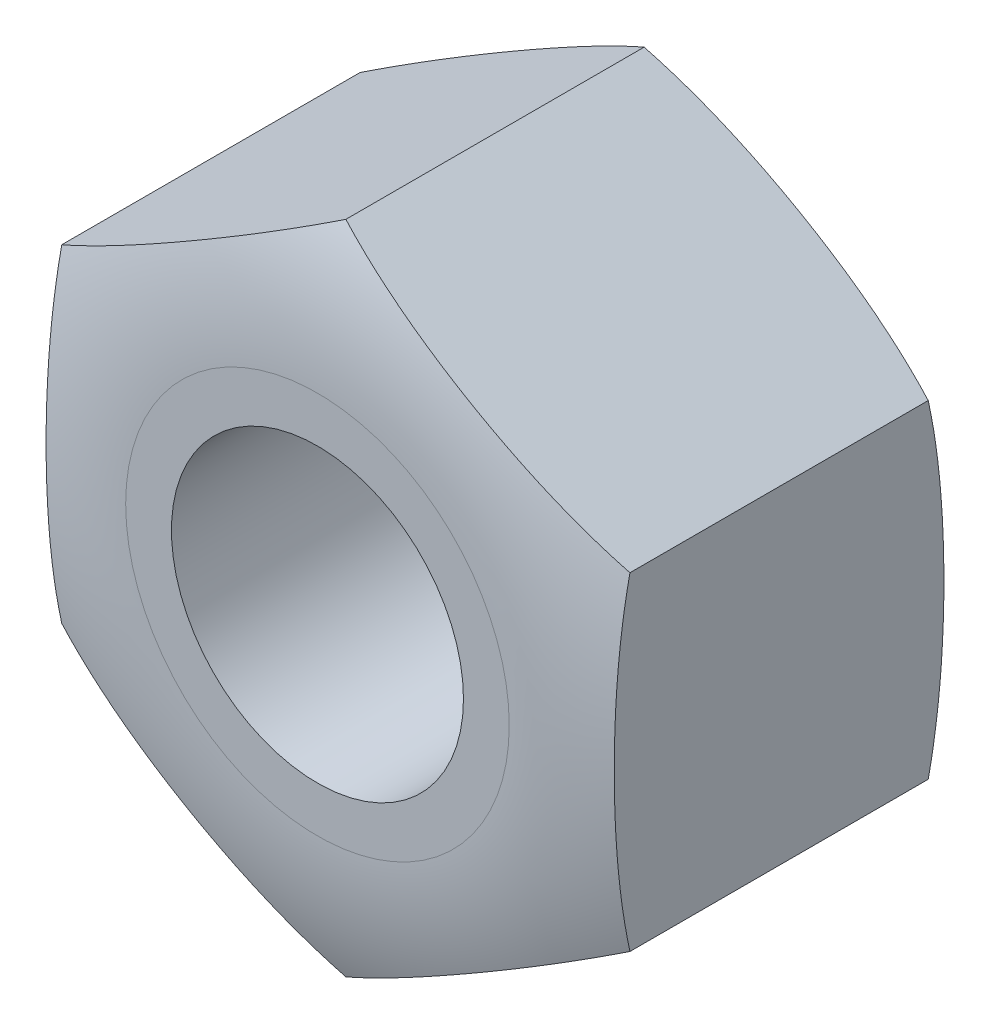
from build123d import *

# Parameters (mm, degrees)
EXTRUDE1_DEPTH           = 3.96875
F_5_16_18_TAPPED_HOLE1_D = 6.5278


with BuildPart() as part:
    # Sketch1 → Extrude1 (new, symmetric)
    with BuildSketch(Plane.XY):
        Polygon((6.35, 3.666174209), (0, 7.332348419), (-6.35, 3.666174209), (-6.35, -3.666174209), (0, -7.332348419), (6.35, -3.666174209), align=None)
    extrude(amount=EXTRUDE1_DEPTH, both=True)

    # 5_16-18 Tapped Hole1 (through all)
    with Locations(Plane.XY.offset(3.96875)):
        with Locations((0, 0)):
            Hole(F_5_16_18_TAPPED_HOLE1_D / 2)

    # Sketch4 → Cut-Revolve1 (revolve, cut)
    with BuildSketch(Plane(origin=(0, 0, 0), x_dir=(0, 0, -1), z_dir=(1, 0, 0)), mode=Mode.PRIVATE) as cut_revolve1_sk:
        with BuildLine():
            Line((-3.96875, 4.286995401), (-3.96875, 7.332348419))
            Line((-3.96875, 7.332348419), (-3.33375, 7.332348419))
            ThreePointArc((-3.33375, 7.332348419), (-3.808310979, 5.842421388), (-3.96875, 4.286995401))
        make_face()
        with BuildLine():
            Line((3.96875, 7.332348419), (3.33375, 7.332348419))
            ThreePointArc((3.33375, 7.332348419), (3.808310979, 5.842421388), (3.96875, 4.286995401))
            Line((3.96875, 4.286995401), (3.96875, 7.332348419))
        make_face()
    revolve(cut_revolve1_sk.sketch.rotate(Axis((0, 0, 3.96875), (0, 0, 1)), 90), axis=Axis((0, 0, 3.96875), (0, 0, 1)), mode=Mode.SUBTRACT)


solid = part.part
